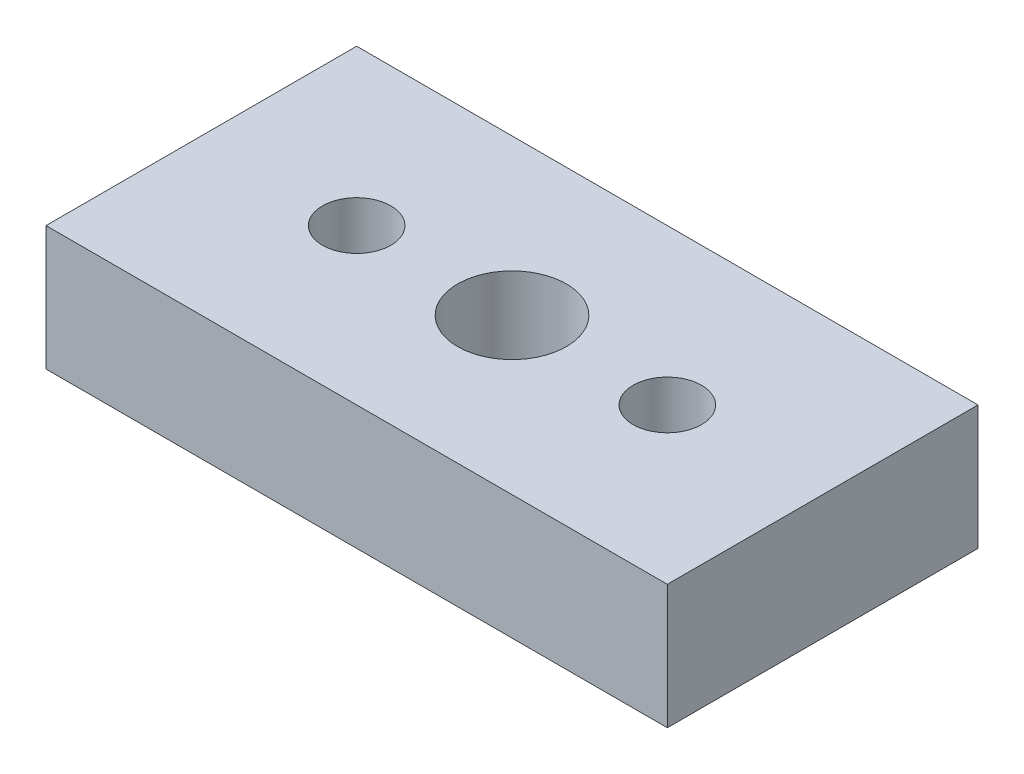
ISO-10303-21;
HEADER;
FILE_DESCRIPTION(('STEP AP214'),'2;1');
FILE_NAME('part.step','',(''),(''),'','','');
FILE_SCHEMA(('AUTOMOTIVE_DESIGN { 1 0 10303 214 1 1 1 1 }'));
ENDSEC;
DATA;
#1=APPLICATION_CONTEXT('core data for automotive mechanical design processes');
#2=APPLICATION_PROTOCOL_DEFINITION('international standard','automotive_design',2000,#1);
#3=PRODUCT_CONTEXT('',#1,'mechanical');
#4=PRODUCT('Part','Part','',(#3));
#5=PRODUCT_RELATED_PRODUCT_CATEGORY('part','',(#4));
#6=PRODUCT_DEFINITION_FORMATION('','',#4);
#7=PRODUCT_DEFINITION_CONTEXT('part definition',#1,'design');
#8=PRODUCT_DEFINITION('design','',#6,#7);
#9=PRODUCT_DEFINITION_SHAPE('','',#8);
#10=(LENGTH_UNIT() NAMED_UNIT(*) SI_UNIT(.MILLI.,.METRE.));
#11=(NAMED_UNIT(*) PLANE_ANGLE_UNIT() SI_UNIT($,.RADIAN.));
#12=(NAMED_UNIT(*) SI_UNIT($,.STERADIAN.) SOLID_ANGLE_UNIT());
#13=UNCERTAINTY_MEASURE_WITH_UNIT(LENGTH_MEASURE(1.E-05),#10,'distance_accuracy_value','');
#14=(GEOMETRIC_REPRESENTATION_CONTEXT(3) GLOBAL_UNCERTAINTY_ASSIGNED_CONTEXT((#13)) GLOBAL_UNIT_ASSIGNED_CONTEXT((#10,
#11,#12)) REPRESENTATION_CONTEXT('',''));
#15=CARTESIAN_POINT('',(0.,0.,0.));
#16=DIRECTION('',(0.,0.,1.));
#17=DIRECTION('',(1.,0.,0.));
#18=AXIS2_PLACEMENT_3D('',#15,#16,#17);
#19=CARTESIAN_POINT('',(-30.,12.,15.));
#20=DIRECTION('',(0.,0.,-1.));
#21=DIRECTION('',(-1.,0.,0.));
#22=AXIS2_PLACEMENT_3D('',#19,#20,#21);
#23=PLANE('',#22);
#24=DIRECTION('',(1.,0.,0.));
#25=VECTOR('',#24,1.);
#26=CARTESIAN_POINT('',(-30.,0.,15.));
#27=LINE('',#26,#25);
#28=CARTESIAN_POINT('',(-30.,0.,15.));
#29=VERTEX_POINT('',#28);
#30=CARTESIAN_POINT('',(30.,0.,15.));
#31=VERTEX_POINT('',#30);
#32=EDGE_CURVE('E102',#29,#31,#27,.T.);
#33=ORIENTED_EDGE('',*,*,#32,.T.);
#34=DIRECTION('',(0.,-1.,0.));
#35=VECTOR('',#34,1.);
#36=CARTESIAN_POINT('',(30.,12.,15.));
#37=LINE('',#36,#35);
#38=CARTESIAN_POINT('',(30.,12.,15.));
#39=VERTEX_POINT('',#38);
#40=EDGE_CURVE('E11',#39,#31,#37,.T.);
#41=ORIENTED_EDGE('',*,*,#40,.F.);
#42=DIRECTION('',(1.,0.,0.));
#43=VECTOR('',#42,1.);
#44=CARTESIAN_POINT('',(-30.,12.,15.));
#45=LINE('',#44,#43);
#46=CARTESIAN_POINT('',(-30.,12.,15.));
#47=VERTEX_POINT('',#46);
#48=EDGE_CURVE('E90',#47,#39,#45,.T.);
#49=ORIENTED_EDGE('',*,*,#48,.F.);
#50=DIRECTION('',(0.,-1.,0.));
#51=VECTOR('',#50,1.);
#52=CARTESIAN_POINT('',(-30.,12.,15.));
#53=LINE('',#52,#51);
#54=EDGE_CURVE('E98',#47,#29,#53,.T.);
#55=ORIENTED_EDGE('',*,*,#54,.T.);
#56=EDGE_LOOP('',(#33,#41,#49,#55));
#57=FACE_BOUND('',#56,.T.);
#58=ADVANCED_FACE('F39',(#57),#23,.F.);
#59=CARTESIAN_POINT('',(30.,12.,-15.));
#60=DIRECTION('',(-1.,0.,0.));
#61=DIRECTION('',(0.,0.,1.));
#62=AXIS2_PLACEMENT_3D('',#59,#60,#61);
#63=PLANE('',#62);
#64=DIRECTION('',(0.,0.,-1.));
#65=VECTOR('',#64,1.);
#66=CARTESIAN_POINT('',(30.,0.,-15.));
#67=LINE('',#66,#65);
#68=CARTESIAN_POINT('',(30.,0.,-15.));
#69=VERTEX_POINT('',#68);
#70=EDGE_CURVE('E94',#31,#69,#67,.T.);
#71=ORIENTED_EDGE('',*,*,#70,.T.);
#72=DIRECTION('',(0.,-1.,0.));
#73=VECTOR('',#72,1.);
#74=CARTESIAN_POINT('',(30.,12.,-15.));
#75=LINE('',#74,#73);
#76=CARTESIAN_POINT('',(30.,12.,-15.));
#77=VERTEX_POINT('',#76);
#78=EDGE_CURVE('E47',#77,#69,#75,.T.);
#79=ORIENTED_EDGE('',*,*,#78,.F.);
#80=DIRECTION('',(0.,0.,-1.));
#81=VECTOR('',#80,1.);
#82=CARTESIAN_POINT('',(30.,12.,-15.));
#83=LINE('',#82,#81);
#84=EDGE_CURVE('E85',#39,#77,#83,.T.);
#85=ORIENTED_EDGE('',*,*,#84,.F.);
#86=ORIENTED_EDGE('',*,*,#40,.T.);
#87=EDGE_LOOP('',(#71,#79,#85,#86));
#88=FACE_BOUND('',#87,.T.);
#89=ADVANCED_FACE('F93',(#88),#63,.F.);
#90=CARTESIAN_POINT('',(-30.,12.,-15.));
#91=DIRECTION('',(0.,0.,1.));
#92=DIRECTION('',(1.,0.,0.));
#93=AXIS2_PLACEMENT_3D('',#90,#91,#92);
#94=PLANE('',#93);
#95=DIRECTION('',(-1.,0.,0.));
#96=VECTOR('',#95,1.);
#97=CARTESIAN_POINT('',(-30.,0.,-15.));
#98=LINE('',#97,#96);
#99=CARTESIAN_POINT('',(-30.,0.,-15.));
#100=VERTEX_POINT('',#99);
#101=EDGE_CURVE('E72',#69,#100,#98,.T.);
#102=ORIENTED_EDGE('',*,*,#101,.T.);
#103=DIRECTION('',(0.,-1.,0.));
#104=VECTOR('',#103,1.);
#105=CARTESIAN_POINT('',(-30.,12.,-15.));
#106=LINE('',#105,#104);
#107=CARTESIAN_POINT('',(-30.,12.,-15.));
#108=VERTEX_POINT('',#107);
#109=EDGE_CURVE('E95',#108,#100,#106,.T.);
#110=ORIENTED_EDGE('',*,*,#109,.F.);
#111=DIRECTION('',(-1.,0.,0.));
#112=VECTOR('',#111,1.);
#113=CARTESIAN_POINT('',(-30.,12.,-15.));
#114=LINE('',#113,#112);
#115=EDGE_CURVE('E88',#77,#108,#114,.T.);
#116=ORIENTED_EDGE('',*,*,#115,.F.);
#117=ORIENTED_EDGE('',*,*,#78,.T.);
#118=EDGE_LOOP('',(#102,#110,#116,#117));
#119=FACE_BOUND('',#118,.T.);
#120=ADVANCED_FACE('F96',(#119),#94,.F.);
#121=CARTESIAN_POINT('',(-30.,12.,-15.));
#122=DIRECTION('',(1.,0.,0.));
#123=DIRECTION('',(0.,0.,-1.));
#124=AXIS2_PLACEMENT_3D('',#121,#122,#123);
#125=PLANE('',#124);
#126=DIRECTION('',(0.,0.,1.));
#127=VECTOR('',#126,1.);
#128=CARTESIAN_POINT('',(-30.,0.,-15.));
#129=LINE('',#128,#127);
#130=EDGE_CURVE('E78',#100,#29,#129,.T.);
#131=ORIENTED_EDGE('',*,*,#130,.T.);
#132=ORIENTED_EDGE('',*,*,#54,.F.);
#133=DIRECTION('',(0.,0.,1.));
#134=VECTOR('',#133,1.);
#135=CARTESIAN_POINT('',(-30.,12.,-15.));
#136=LINE('',#135,#134);
#137=EDGE_CURVE('E55',#108,#47,#136,.T.);
#138=ORIENTED_EDGE('',*,*,#137,.F.);
#139=ORIENTED_EDGE('',*,*,#109,.T.);
#140=EDGE_LOOP('',(#131,#132,#138,#139));
#141=FACE_BOUND('',#140,.T.);
#142=ADVANCED_FACE('F110',(#141),#125,.F.);
#143=CARTESIAN_POINT('',(30.,12.,15.));
#144=DIRECTION('',(0.,-1.,0.));
#145=DIRECTION('',(0.,0.,-1.));
#146=AXIS2_PLACEMENT_3D('',#143,#144,#145);
#147=PLANE('',#146);
#148=CARTESIAN_POINT('',(-15.,12.,0.));
#149=DIRECTION('',(0.,-1.,0.));
#150=DIRECTION('',(0.,0.,-1.));
#151=AXIS2_PLACEMENT_3D('',#148,#149,#150);
#152=CIRCLE('',#151,3.30000000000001);
#153=CARTESIAN_POINT('',(-15.,12.,-3.30000000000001));
#154=VERTEX_POINT('',#153);
#155=EDGE_CURVE('E133',#154,#154,#152,.T.);
#156=ORIENTED_EDGE('',*,*,#155,.T.);
#157=EDGE_LOOP('',(#156));
#158=FACE_BOUND('',#157,.T.);
#159=CARTESIAN_POINT('',(15.,12.,0.));
#160=DIRECTION('',(0.,-1.,0.));
#161=DIRECTION('',(0.,0.,-1.));
#162=AXIS2_PLACEMENT_3D('',#159,#160,#161);
#163=CIRCLE('',#162,3.30000000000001);
#164=CARTESIAN_POINT('',(15.,12.,-3.30000000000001));
#165=VERTEX_POINT('',#164);
#166=EDGE_CURVE('E121',#165,#165,#163,.T.);
#167=ORIENTED_EDGE('',*,*,#166,.T.);
#168=EDGE_LOOP('',(#167));
#169=FACE_BOUND('',#168,.T.);
#170=CARTESIAN_POINT('',(0.,12.,0.));
#171=DIRECTION('',(0.,1.,0.));
#172=DIRECTION('',(0.,0.,1.));
#173=AXIS2_PLACEMENT_3D('',#170,#171,#172);
#174=CIRCLE('',#173,5.25);
#175=CARTESIAN_POINT('',(0.,12.,5.25));
#176=VERTEX_POINT('',#175);
#177=EDGE_CURVE('E118',#176,#176,#174,.T.);
#178=ORIENTED_EDGE('',*,*,#177,.F.);
#179=EDGE_LOOP('',(#178));
#180=FACE_BOUND('',#179,.T.);
#181=ORIENTED_EDGE('',*,*,#48,.T.);
#182=ORIENTED_EDGE('',*,*,#84,.T.);
#183=ORIENTED_EDGE('',*,*,#115,.T.);
#184=ORIENTED_EDGE('',*,*,#137,.T.);
#185=EDGE_LOOP('',(#181,#182,#183,#184));
#186=FACE_BOUND('',#185,.T.);
#187=ADVANCED_FACE('F86',(#158,#169,#180,#186),#147,.F.);
#188=CARTESIAN_POINT('',(30.,0.,15.));
#189=DIRECTION('',(0.,-1.,0.));
#190=DIRECTION('',(0.,0.,-1.));
#191=AXIS2_PLACEMENT_3D('',#188,#189,#190);
#192=PLANE('',#191);
#193=CARTESIAN_POINT('',(-15.,0.,0.));
#194=DIRECTION('',(0.,-1.,0.));
#195=DIRECTION('',(0.,0.,-1.));
#196=AXIS2_PLACEMENT_3D('',#193,#194,#195);
#197=CIRCLE('',#196,5.50000000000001);
#198=CARTESIAN_POINT('',(-15.,0.,-5.50000000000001));
#199=VERTEX_POINT('',#198);
#200=EDGE_CURVE('E142',#199,#199,#197,.T.);
#201=ORIENTED_EDGE('',*,*,#200,.F.);
#202=EDGE_LOOP('',(#201));
#203=FACE_BOUND('',#202,.T.);
#204=CARTESIAN_POINT('',(15.,0.,0.));
#205=DIRECTION('',(0.,-1.,0.));
#206=DIRECTION('',(0.,0.,-1.));
#207=AXIS2_PLACEMENT_3D('',#204,#205,#206);
#208=CIRCLE('',#207,5.50000000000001);
#209=CARTESIAN_POINT('',(15.,0.,-5.50000000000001));
#210=VERTEX_POINT('',#209);
#211=EDGE_CURVE('E130',#210,#210,#208,.T.);
#212=ORIENTED_EDGE('',*,*,#211,.F.);
#213=EDGE_LOOP('',(#212));
#214=FACE_BOUND('',#213,.T.);
#215=CARTESIAN_POINT('',(0.,0.,0.));
#216=DIRECTION('',(0.,1.,0.));
#217=DIRECTION('',(0.,0.,1.));
#218=AXIS2_PLACEMENT_3D('',#215,#216,#217);
#219=CIRCLE('',#218,5.25);
#220=CARTESIAN_POINT('',(0.,0.,5.25));
#221=VERTEX_POINT('',#220);
#222=EDGE_CURVE('E105',#221,#221,#219,.T.);
#223=ORIENTED_EDGE('',*,*,#222,.T.);
#224=EDGE_LOOP('',(#223));
#225=FACE_BOUND('',#224,.T.);
#226=ORIENTED_EDGE('',*,*,#32,.F.);
#227=ORIENTED_EDGE('',*,*,#130,.F.);
#228=ORIENTED_EDGE('',*,*,#101,.F.);
#229=ORIENTED_EDGE('',*,*,#70,.F.);
#230=EDGE_LOOP('',(#226,#227,#228,#229));
#231=FACE_BOUND('',#230,.T.);
#232=ADVANCED_FACE('F113',(#203,#214,#225,#231),#192,.T.);
#233=CARTESIAN_POINT('',(0.,12.,0.));
#234=DIRECTION('',(0.,1.,0.));
#235=DIRECTION('',(0.,0.,1.));
#236=AXIS2_PLACEMENT_3D('',#233,#234,#235);
#237=CYLINDRICAL_SURFACE('',#236,5.25);
#238=ORIENTED_EDGE('',*,*,#222,.F.);
#239=EDGE_LOOP('',(#238));
#240=FACE_BOUND('',#239,.T.);
#241=ORIENTED_EDGE('',*,*,#177,.T.);
#242=EDGE_LOOP('',(#241));
#243=FACE_BOUND('',#242,.T.);
#244=ADVANCED_FACE('F150',(#240,#243),#237,.F.);
#245=CARTESIAN_POINT('',(15.,0.,0.));
#246=DIRECTION('',(0.,-1.,0.));
#247=DIRECTION('',(0.,0.,-1.));
#248=AXIS2_PLACEMENT_3D('',#245,#246,#247);
#249=CYLINDRICAL_SURFACE('',#248,3.30000000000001);
#250=ORIENTED_EDGE('',*,*,#166,.F.);
#251=EDGE_LOOP('',(#250));
#252=FACE_BOUND('',#251,.T.);
#253=CARTESIAN_POINT('',(15.,6.5,0.));
#254=DIRECTION('',(0.,-1.,0.));
#255=DIRECTION('',(0.,0.,-1.));
#256=AXIS2_PLACEMENT_3D('',#253,#254,#255);
#257=CIRCLE('',#256,3.30000000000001);
#258=CARTESIAN_POINT('',(15.,6.5,-3.30000000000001));
#259=VERTEX_POINT('',#258);
#260=EDGE_CURVE('E124',#259,#259,#257,.T.);
#261=ORIENTED_EDGE('',*,*,#260,.T.);
#262=EDGE_LOOP('',(#261));
#263=FACE_BOUND('',#262,.T.);
#264=ADVANCED_FACE('F158',(#252,#263),#249,.F.);
#265=CARTESIAN_POINT('',(18.3,6.5,0.));
#266=DIRECTION('',(0.,1.,0.));
#267=DIRECTION('',(0.,0.,1.));
#268=AXIS2_PLACEMENT_3D('',#265,#266,#267);
#269=PLANE('',#268);
#270=ORIENTED_EDGE('',*,*,#260,.F.);
#271=EDGE_LOOP('',(#270));
#272=FACE_BOUND('',#271,.T.);
#273=CARTESIAN_POINT('',(15.,6.5,0.));
#274=DIRECTION('',(0.,-1.,0.));
#275=DIRECTION('',(0.,0.,-1.));
#276=AXIS2_PLACEMENT_3D('',#273,#274,#275);
#277=CIRCLE('',#276,5.50000000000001);
#278=CARTESIAN_POINT('',(15.,6.5,-5.50000000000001));
#279=VERTEX_POINT('',#278);
#280=EDGE_CURVE('E127',#279,#279,#277,.T.);
#281=ORIENTED_EDGE('',*,*,#280,.T.);
#282=EDGE_LOOP('',(#281));
#283=FACE_BOUND('',#282,.T.);
#284=ADVANCED_FACE('F211',(#272,#283),#269,.F.);
#285=CARTESIAN_POINT('',(15.,0.,0.));
#286=DIRECTION('',(0.,-1.,0.));
#287=DIRECTION('',(0.,0.,-1.));
#288=AXIS2_PLACEMENT_3D('',#285,#286,#287);
#289=CYLINDRICAL_SURFACE('',#288,5.50000000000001);
#290=ORIENTED_EDGE('',*,*,#280,.F.);
#291=EDGE_LOOP('',(#290));
#292=FACE_BOUND('',#291,.T.);
#293=ORIENTED_EDGE('',*,*,#211,.T.);
#294=EDGE_LOOP('',(#293));
#295=FACE_BOUND('',#294,.T.);
#296=ADVANCED_FACE('F221',(#292,#295),#289,.F.);
#297=CARTESIAN_POINT('',(-15.,0.,0.));
#298=DIRECTION('',(0.,-1.,0.));
#299=DIRECTION('',(0.,0.,-1.));
#300=AXIS2_PLACEMENT_3D('',#297,#298,#299);
#301=CYLINDRICAL_SURFACE('',#300,3.30000000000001);
#302=ORIENTED_EDGE('',*,*,#155,.F.);
#303=EDGE_LOOP('',(#302));
#304=FACE_BOUND('',#303,.T.);
#305=CARTESIAN_POINT('',(-15.,6.5,0.));
#306=DIRECTION('',(0.,-1.,0.));
#307=DIRECTION('',(0.,0.,-1.));
#308=AXIS2_PLACEMENT_3D('',#305,#306,#307);
#309=CIRCLE('',#308,3.30000000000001);
#310=CARTESIAN_POINT('',(-15.,6.5,-3.30000000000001));
#311=VERTEX_POINT('',#310);
#312=EDGE_CURVE('E136',#311,#311,#309,.T.);
#313=ORIENTED_EDGE('',*,*,#312,.T.);
#314=EDGE_LOOP('',(#313));
#315=FACE_BOUND('',#314,.T.);
#316=ADVANCED_FACE('F231',(#304,#315),#301,.F.);
#317=CARTESIAN_POINT('',(-11.7,6.5,0.));
#318=DIRECTION('',(0.,1.,0.));
#319=DIRECTION('',(0.,0.,1.));
#320=AXIS2_PLACEMENT_3D('',#317,#318,#319);
#321=PLANE('',#320);
#322=ORIENTED_EDGE('',*,*,#312,.F.);
#323=EDGE_LOOP('',(#322));
#324=FACE_BOUND('',#323,.T.);
#325=CARTESIAN_POINT('',(-15.,6.5,0.));
#326=DIRECTION('',(0.,-1.,0.));
#327=DIRECTION('',(0.,0.,-1.));
#328=AXIS2_PLACEMENT_3D('',#325,#326,#327);
#329=CIRCLE('',#328,5.50000000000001);
#330=CARTESIAN_POINT('',(-15.,6.5,-5.50000000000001));
#331=VERTEX_POINT('',#330);
#332=EDGE_CURVE('E139',#331,#331,#329,.T.);
#333=ORIENTED_EDGE('',*,*,#332,.T.);
#334=EDGE_LOOP('',(#333));
#335=FACE_BOUND('',#334,.T.);
#336=ADVANCED_FACE('F241',(#324,#335),#321,.F.);
#337=CARTESIAN_POINT('',(-15.,0.,0.));
#338=DIRECTION('',(0.,-1.,0.));
#339=DIRECTION('',(0.,0.,-1.));
#340=AXIS2_PLACEMENT_3D('',#337,#338,#339);
#341=CYLINDRICAL_SURFACE('',#340,5.50000000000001);
#342=ORIENTED_EDGE('',*,*,#332,.F.);
#343=EDGE_LOOP('',(#342));
#344=FACE_BOUND('',#343,.T.);
#345=ORIENTED_EDGE('',*,*,#200,.T.);
#346=EDGE_LOOP('',(#345));
#347=FACE_BOUND('',#346,.T.);
#348=ADVANCED_FACE('F146',(#344,#347),#341,.F.);
#349=CLOSED_SHELL('',(#58,#89,#120,#142,#187,#232,#244,#264,#284,#296,#316,#336,#348));
#350=MANIFOLD_SOLID_BREP('B2',#349);
#351=ADVANCED_BREP_SHAPE_REPRESENTATION('',(#18,#350),#14);
#352=SHAPE_DEFINITION_REPRESENTATION(#9,#351);
ENDSEC;
END-ISO-10303-21;
